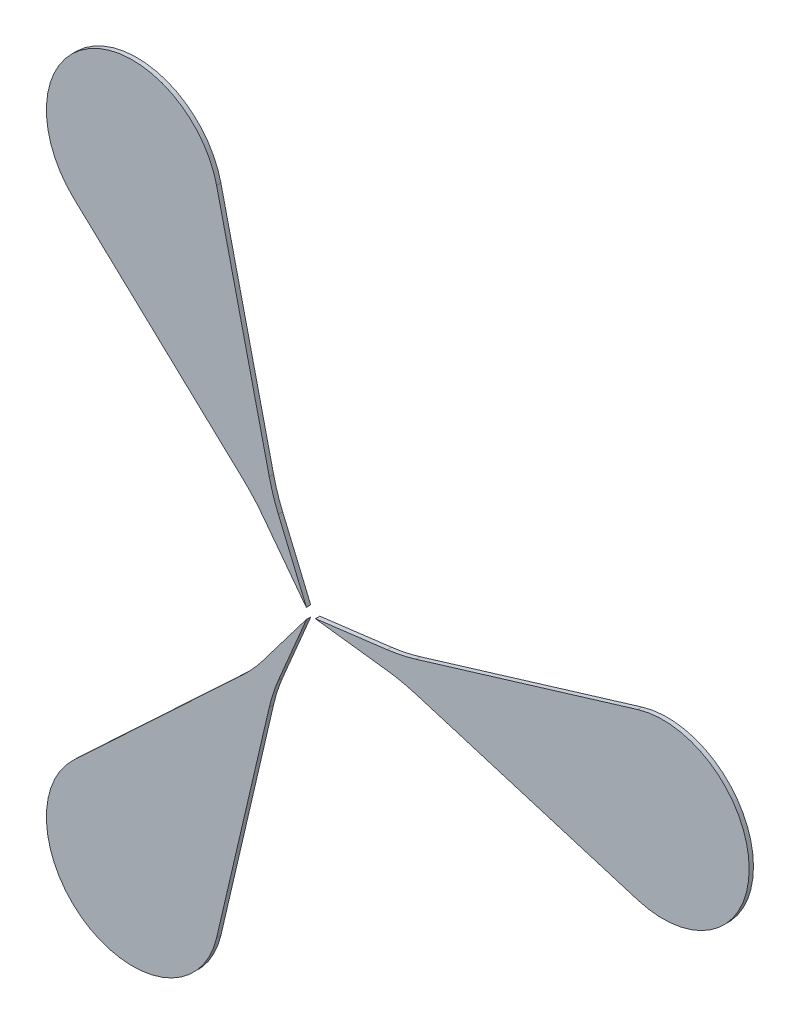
from build123d import *

# Parameters (mm, degrees)
EXTRUDE_2_DEPTH   = 0.25
EXTRUDE_2_2_DEPTH = 0.25
EXTRUDE_2_3_DEPTH = 0.25


with BuildPart() as part:
    # Sketch 1 → Extrude 2 (new body)
    with BuildSketch(Plane.XY):
        with BuildLine():
            Line((0.357380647, 0.004961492), (4.50941379, 0.523267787))
            ThreePointArc((4.50941379, 0.523267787), (5.349803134, 0.664770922), (6.175092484, 0.877314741))
            Line((6.175092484, 0.877314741), (19.047808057, 4.784468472))
            ThreePointArc((19.047808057, 4.784468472), (25.5, 0), (19.047808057, -4.784468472))
            Line((19.047808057, -4.784468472), (6.175092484, -0.877314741))
            ThreePointArc((6.175092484, -0.877314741), (5.349803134, -0.664770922), (4.50941379, -0.523267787))
            Line((4.50941379, -0.523267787), (0.357380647, -0.004961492))
            ThreePointArc((0.357380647, -0.004961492), (0.353, 0), (0.357380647, 0.004961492))
        make_face()
    extrude(amount=EXTRUDE_2_DEPTH)


with BuildPart() as body_2:
    # Sketch 1 → Extrude 2 2 (new body)
    with BuildSketch(Plane.XY):
        with BuildLine():
            Line((-0.182987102, -0.307019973), (-2.707870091, -3.643633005))
            ThreePointArc((-2.707870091, -3.643633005), (-3.250610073, -4.300679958), (-3.847323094, -4.909129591))
            Line((-3.847323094, -4.909129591), (-13.667375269, -14.103651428))
            ThreePointArc((-13.667375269, -14.103651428), (-12.75, -22.083647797), (-5.380432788, -18.8881199))
            Line((-5.380432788, -18.8881199), (-2.327769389, -5.786444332))
            ThreePointArc((-2.327769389, -5.786444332), (-2.09919306, -4.96545088), (-1.801543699, -4.166900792))
            Line((-1.801543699, -4.166900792), (-0.174393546, -0.311981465))
            ThreePointArc((-0.174393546, -0.311981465), (-0.1765, -0.305706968), (-0.182987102, -0.307019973))
        make_face()
    extrude(amount=EXTRUDE_2_2_DEPTH)


with BuildPart() as body_3:
    # Sketch 1 → Extrude 2 3 (new body)
    with BuildSketch(Plane.XY):
        with BuildLine():
            Line((-0.174393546, 0.311981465), (-1.801543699, 4.166900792))
            ThreePointArc((-1.801543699, 4.166900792), (-2.09919306, 4.96545088), (-2.327769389, 5.786444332))
            Line((-2.327769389, 5.786444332), (-5.380432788, 18.8881199))
            ThreePointArc((-5.380432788, 18.8881199), (-12.75, 22.083647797), (-13.667375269, 14.103651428))
            Line((-13.667375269, 14.103651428), (-3.847323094, 4.909129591))
            ThreePointArc((-3.847323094, 4.909129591), (-3.250610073, 4.300679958), (-2.707870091, 3.643633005))
            Line((-2.707870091, 3.643633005), (-0.182987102, 0.307019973))
            ThreePointArc((-0.182987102, 0.307019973), (-0.1765, 0.305706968), (-0.174393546, 0.311981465))
        make_face()
    extrude(amount=EXTRUDE_2_3_DEPTH)


solid = Compound([part.part, body_2.part, body_3.part])
